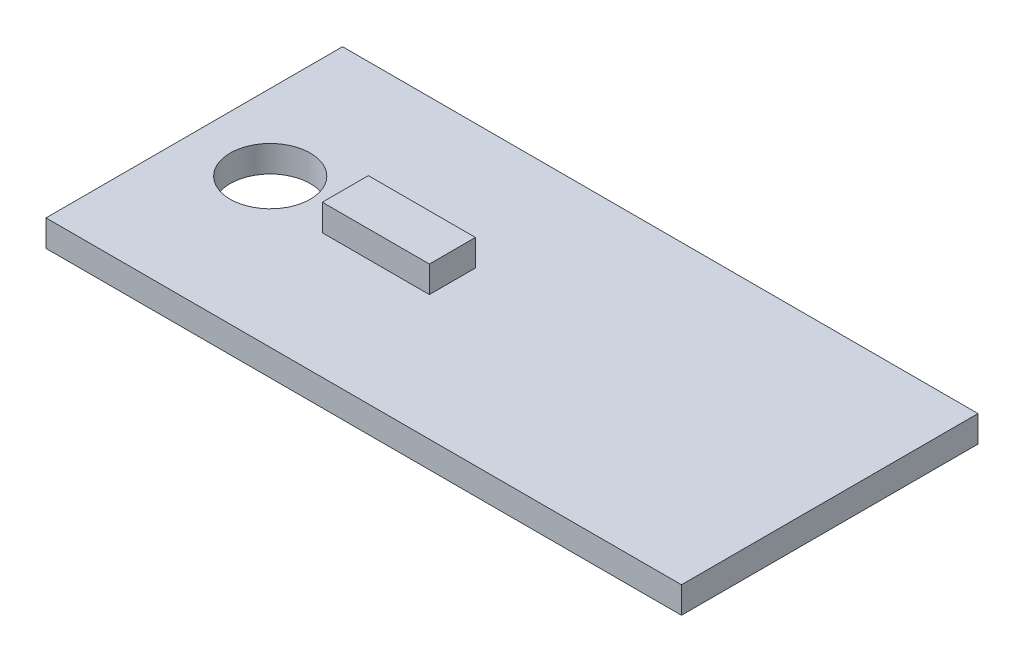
from build123d import *

# Parameters (mm, degrees)
SKETCH1_W            = 19.05
SKETCH1_H            = 8.89
BOSS_EXTRUDE1_DEPTH  = 0.79375
SKETCH2_W            = 3.210041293
SKETCH2_H            = 1.379882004
BOSS_EXTRUDE2_DEPTH  = 0.79375
M2_CLEARANCE_HOLE1_D = 2.4


with BuildPart() as part:
    # Sketch1 → Boss-Extrude1 (new body)
    with BuildSketch(Plane(origin=(0, 0, 0), x_dir=(1, 0, 0), z_dir=(0, 1, 0))):
        with Locations((9.525, 0)):
            Rectangle(SKETCH1_W, SKETCH1_H)
    extrude(amount=BOSS_EXTRUDE1_DEPTH)

    # Sketch2 → Boss-Extrude2 (add)
    with BuildSketch(Plane(origin=(0, 0.79375, 0), x_dir=(1, 0, 0), z_dir=(0, 1, 0))):
        with Locations((6.133395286, 0)):
            Rectangle(SKETCH2_W, SKETCH2_H)
    extrude(amount=BOSS_EXTRUDE2_DEPTH)

    # M2 Clearance Hole1 (through all)
    with Locations(Plane(origin=(0, 0.79375, 0), x_dir=(1, 0, 0), z_dir=(0, 1, 0))):
        with Locations((2.276988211, 0)):
            Hole(M2_CLEARANCE_HOLE1_D / 2)


solid = part.part
